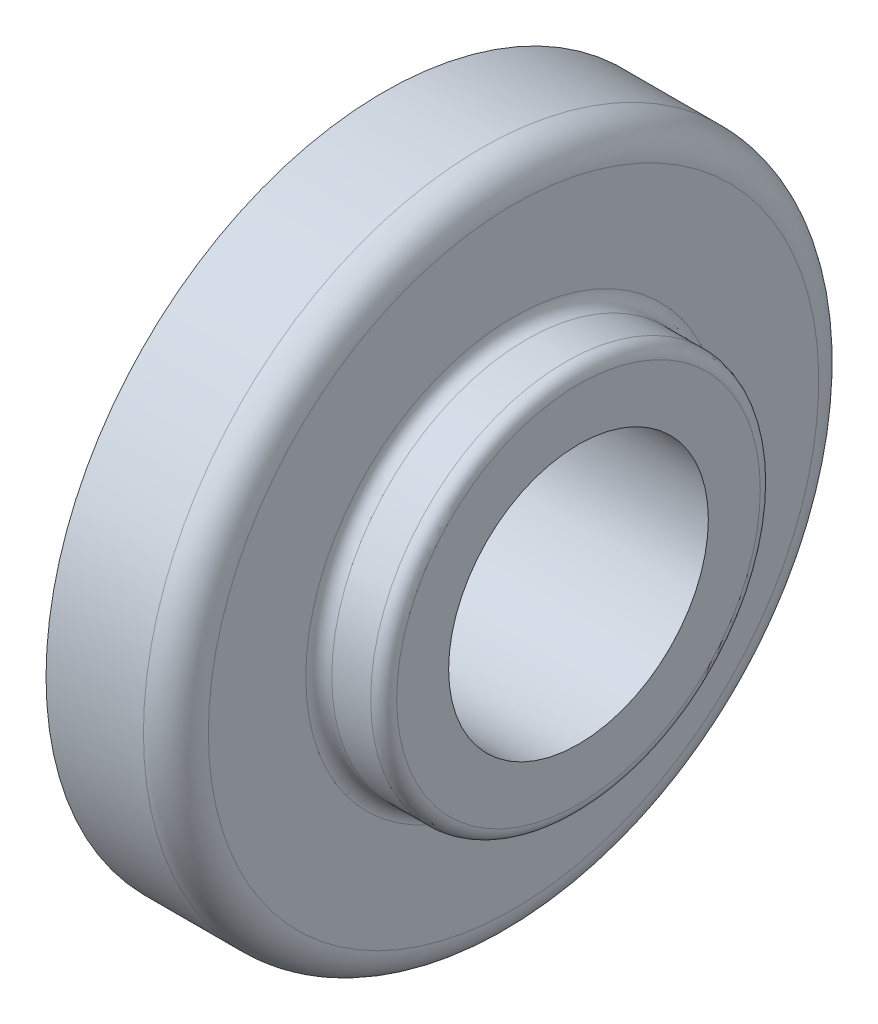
from build123d import *

# Parameters (mm, degrees)
SKETCH2_R      = 10
EXTRUDE1_DEPTH = 45.852081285


with BuildPart() as part:
    # Sketch1 → Revolve1 (revolve)
    with BuildSketch(Plane(origin=(0, 0, 0), x_dir=(1, 0, 0), z_dir=(0, 1, 0)), mode=Mode.PRIVATE) as revolve1_sk:
        with BuildLine():
            Line((-2.818193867, -7.327304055), (1.105880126, -7.327304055))
            Line((1.105880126, -7.327304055), (12.181806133, -7.327304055))
            Line((12.181806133, -7.327304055), (12.181806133, 6.672695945))
            ThreePointArc((12.181806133, 6.672695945), (11.888912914, 7.379802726), (11.181806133, 7.672695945))
            Line((11.181806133, 7.672695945), (8.181806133, 7.672695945))
            ThreePointArc((8.181806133, 7.672695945), (7.474699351, 7.965589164), (7.181806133, 8.672695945))
            Line((7.181806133, 8.672695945), (7.181806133, 16.172695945))
            ThreePointArc((7.181806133, 16.172695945), (6.449573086, 17.940462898), (4.681806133, 18.672695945))
            Line((4.681806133, 18.672695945), (-2.818193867, 18.672695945))
            Line((-2.818193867, 18.672695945), (-2.818193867, -7.327304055))
        make_face()
    revolve(revolve1_sk.sketch.rotate(Axis((-2.818193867, 0, 7.327304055), (1, 0, 0)), 180), axis=Axis((-2.818193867, 0, 7.327304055), (1, 0, 0)))

    # Sketch2 → Extrude1 (cut, through all)
    with BuildSketch(Plane(origin=(12.181806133, 0, 0), x_dir=(0, 0, -1), z_dir=(1, 0, 0))):
        with Locations((-7.327304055, 0)):
            Circle(SKETCH2_R)
    extrude(amount=-EXTRUDE1_DEPTH, mode=Mode.SUBTRACT)


solid = part.part
